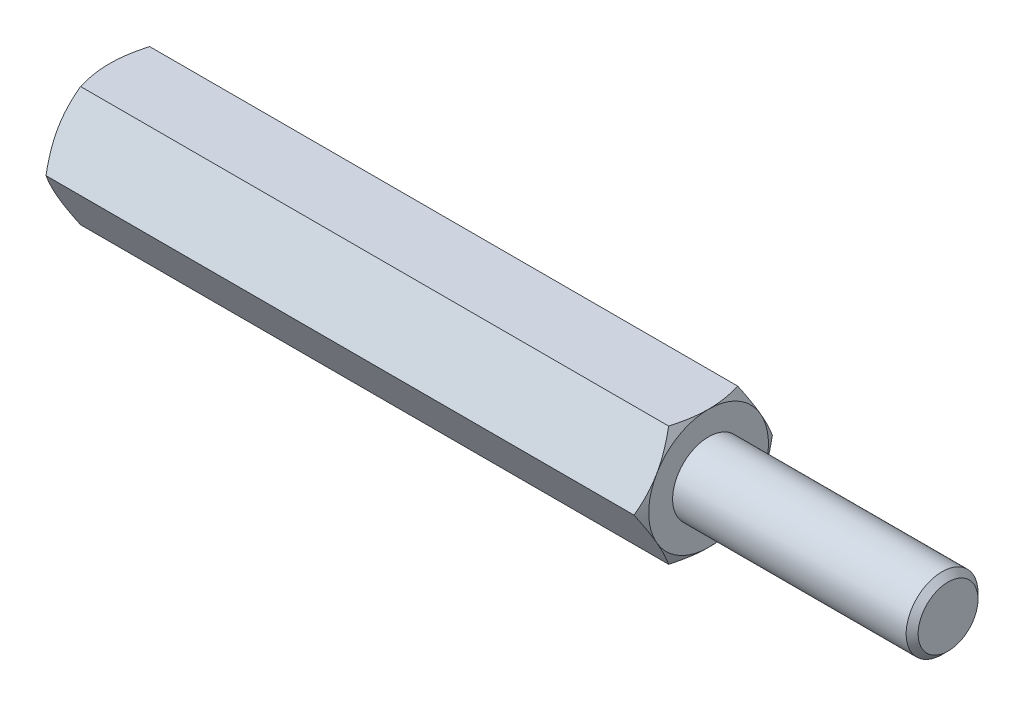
from build123d import *

# Parameters (mm, degrees)
EXTRUDE2_DEPTH = 12.5
SKETCH3_R      = 1.25
EXTRUDE3_DEPTH = 10
SKETCH5_R      = 1.5
EXTRUDE4_DEPTH = 10
CHAMFER1_SIZE  = 0.25


with BuildPart() as part:
    # Sketch1 → Extrude2 (new, symmetric)
    with BuildSketch(Plane(origin=(0, 0, 0), x_dir=(0, 0, -1), z_dir=(1, 0, 0))):
        Polygon((1.443375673, 2.5), (-1.443375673, 2.5), (-2.886751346, 0), (-1.443375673, -2.5), (1.443375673, -2.5), (2.886751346, 0), align=None)
    extrude(amount=EXTRUDE2_DEPTH, both=True)

    # Sketch2 → Cut-Revolve1 (revolve, cut)
    with BuildSketch(Plane.XY):
        with BuildLine():
            Line((-12.5, 2.5), (-11, 5.098076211))
            ThreePointArc((-11, 5.098076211), (-11.48810136, 6.276457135), (-12.5, 5.5))
            Line((-12.5, 5.5), (-12.5, 2.5))
        make_face()
    cut_revolve1 = revolve(axis=Axis((0, 0, 0), (1, 0, 0)), mode=Mode.SUBTRACT)

    # Mirror1: Cut-Revolve1 across plane
    add(cut_revolve1.mirror(Plane(origin=(0, 0, 0), x_dir=(0, 0, 1), z_dir=(1, 0, 0))), mode=Mode.SUBTRACT)

    # Sketch3 → Extrude3 (cut)
    with BuildSketch(Plane.ZY.offset(12.5)):
        Circle(SKETCH3_R)
    extrude(amount=-EXTRUDE3_DEPTH, mode=Mode.SUBTRACT)

    # Sketch4 → Cut-Revolve2 (revolve, cut)
    with BuildSketch(Plane.XY, mode=Mode.PRIVATE) as cut_revolve2_sk:
        Polygon((-2.5, 0), (-2.5, 1.25), (-1.778312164, 0), align=None)
    revolve(cut_revolve2_sk.sketch.rotate(Axis((-1.778312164, 0, 0), (-1, 0, 0)), 270), axis=Axis((-1.778312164, 0, 0), (-1, 0, 0)), mode=Mode.SUBTRACT)

    # Sketch5 → Extrude4 (add)
    with BuildSketch(Plane(origin=(12.5, 0, 0), x_dir=(0, 0, -1), z_dir=(1, 0, 0))):
        Circle(SKETCH5_R)
    extrude(amount=EXTRUDE4_DEPTH)

    # Chamfer1
    chamfer1_edges = [part.edges().sort_by_distance(p)[0] for p in [
        (22.5, 0, 1.5),
    ]]
    chamfer(chamfer1_edges, length=CHAMFER1_SIZE)


solid = part.part
